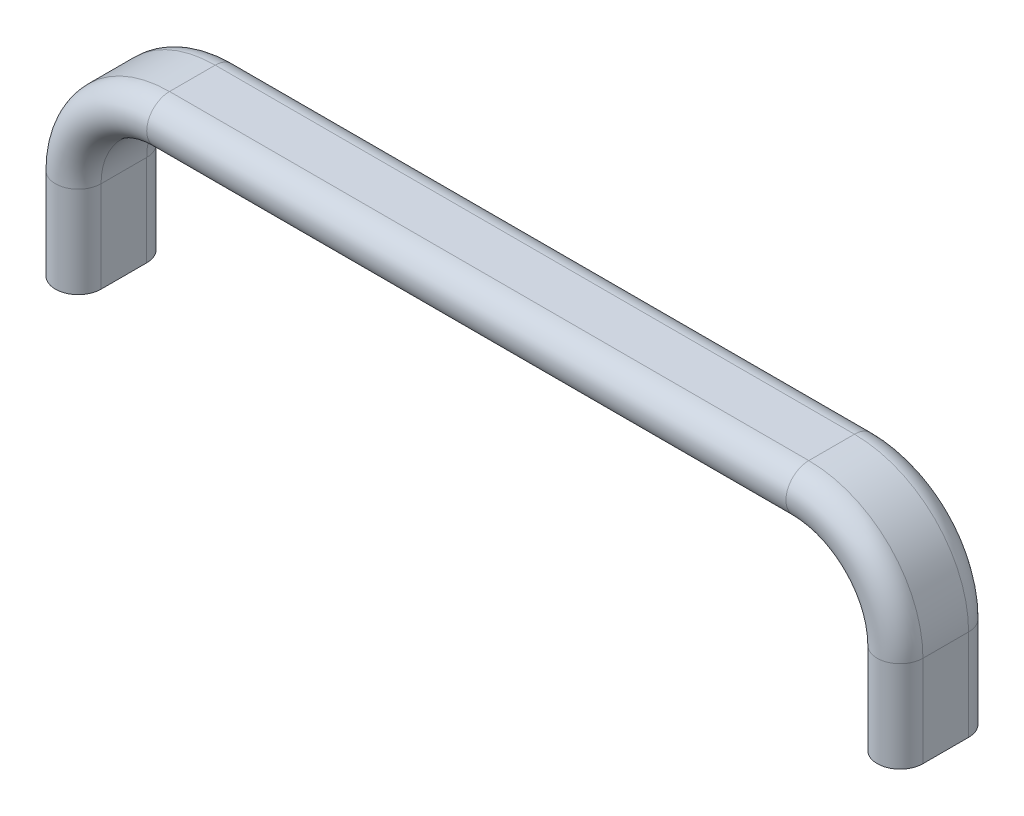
ISO-10303-21;
HEADER;
FILE_DESCRIPTION(('STEP AP214'),'2;1');
FILE_NAME('part.step','',(''),(''),'','','');
FILE_SCHEMA(('AUTOMOTIVE_DESIGN { 1 0 10303 214 1 1 1 1 }'));
ENDSEC;
DATA;
#1=APPLICATION_CONTEXT('core data for automotive mechanical design processes');
#2=APPLICATION_PROTOCOL_DEFINITION('international standard','automotive_design',2000,#1);
#3=PRODUCT_CONTEXT('',#1,'mechanical');
#4=PRODUCT('Part','Part','',(#3));
#5=PRODUCT_RELATED_PRODUCT_CATEGORY('part','',(#4));
#6=PRODUCT_DEFINITION_FORMATION('','',#4);
#7=PRODUCT_DEFINITION_CONTEXT('part definition',#1,'design');
#8=PRODUCT_DEFINITION('design','',#6,#7);
#9=PRODUCT_DEFINITION_SHAPE('','',#8);
#10=(LENGTH_UNIT() NAMED_UNIT(*) SI_UNIT(.MILLI.,.METRE.));
#11=(NAMED_UNIT(*) PLANE_ANGLE_UNIT() SI_UNIT($,.RADIAN.));
#12=(NAMED_UNIT(*) SI_UNIT($,.STERADIAN.) SOLID_ANGLE_UNIT());
#13=UNCERTAINTY_MEASURE_WITH_UNIT(LENGTH_MEASURE(1.E-05),#10,'distance_accuracy_value','');
#14=(GEOMETRIC_REPRESENTATION_CONTEXT(3) GLOBAL_UNCERTAINTY_ASSIGNED_CONTEXT((#13)) GLOBAL_UNIT_ASSIGNED_CONTEXT((#10,
#11,#12)) REPRESENTATION_CONTEXT('',''));
#15=CARTESIAN_POINT('',(0.,0.,0.));
#16=DIRECTION('',(0.,0.,1.));
#17=DIRECTION('',(1.,0.,0.));
#18=AXIS2_PLACEMENT_3D('',#15,#16,#17);
#19=CARTESIAN_POINT('',(90.,0.,-5.));
#20=DIRECTION('',(0.,1.,0.));
#21=DIRECTION('',(0.,0.,-1.));
#22=AXIS2_PLACEMENT_3D('',#19,#20,#21);
#23=PLANE('',#22);
#24=CARTESIAN_POINT('',(90.,0.,-5.));
#25=DIRECTION('',(0.,-1.,0.));
#26=DIRECTION('',(0.,0.,-1.));
#27=AXIS2_PLACEMENT_3D('',#24,#25,#26);
#28=CIRCLE('',#27,5.);
#29=CARTESIAN_POINT('',(85.,0.,-5.));
#30=VERTEX_POINT('',#29);
#31=CARTESIAN_POINT('',(95.,0.,-5.));
#32=VERTEX_POINT('',#31);
#33=EDGE_CURVE('E278',#30,#32,#28,.T.);
#34=ORIENTED_EDGE('',*,*,#33,.T.);
#35=DIRECTION('',(0.,0.,1.));
#36=VECTOR('',#35,1.);
#37=CARTESIAN_POINT('',(95.,0.,5.00000000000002));
#38=LINE('',#37,#36);
#39=CARTESIAN_POINT('',(95.,0.,5.00000000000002));
#40=VERTEX_POINT('',#39);
#41=EDGE_CURVE('E55',#32,#40,#38,.T.);
#42=ORIENTED_EDGE('',*,*,#41,.T.);
#43=CARTESIAN_POINT('',(90.,0.,5.00000000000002));
#44=DIRECTION('',(0.,-1.,0.));
#45=DIRECTION('',(0.,0.,1.));
#46=AXIS2_PLACEMENT_3D('',#43,#44,#45);
#47=CIRCLE('',#46,5.);
#48=CARTESIAN_POINT('',(85.,0.,5.00000000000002));
#49=VERTEX_POINT('',#48);
#50=EDGE_CURVE('E63',#40,#49,#47,.T.);
#51=ORIENTED_EDGE('',*,*,#50,.T.);
#52=DIRECTION('',(0.,0.,-1.));
#53=VECTOR('',#52,1.);
#54=CARTESIAN_POINT('',(85.,0.,-5.));
#55=LINE('',#54,#53);
#56=EDGE_CURVE('E281',#49,#30,#55,.T.);
#57=ORIENTED_EDGE('',*,*,#56,.T.);
#58=EDGE_LOOP('',(#34,#42,#51,#57));
#59=FACE_BOUND('',#58,.T.);
#60=CARTESIAN_POINT('',(90.,0.,0.));
#61=DIRECTION('',(0.,1.,0.));
#62=DIRECTION('',(0.,0.,-1.));
#63=AXIS2_PLACEMENT_3D('',#60,#61,#62);
#64=CIRCLE('',#63,2.5);
#65=CARTESIAN_POINT('',(90.,0.,-2.5));
#66=VERTEX_POINT('',#65);
#67=EDGE_CURVE('E444',#66,#66,#64,.T.);
#68=ORIENTED_EDGE('',*,*,#67,.T.);
#69=EDGE_LOOP('',(#68));
#70=FACE_BOUND('',#69,.T.);
#71=ADVANCED_FACE('F37',(#59,#70),#23,.F.);
#72=CARTESIAN_POINT('',(95.,20.,5.00000000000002));
#73=DIRECTION('',(1.,0.,0.));
#74=DIRECTION('',(0.,0.,-1.));
#75=AXIS2_PLACEMENT_3D('',#72,#73,#74);
#76=PLANE('',#75);
#77=DIRECTION('',(0.,0.,1.));
#78=VECTOR('',#77,1.);
#79=CARTESIAN_POINT('',(95.,20.,5.00000000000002));
#80=LINE('',#79,#78);
#81=CARTESIAN_POINT('',(95.,20.,-5.));
#82=VERTEX_POINT('',#81);
#83=CARTESIAN_POINT('',(95.,20.,5.00000000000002));
#84=VERTEX_POINT('',#83);
#85=EDGE_CURVE('E247',#82,#84,#80,.T.);
#86=ORIENTED_EDGE('',*,*,#85,.T.);
#87=DIRECTION('',(0.,-1.,0.));
#88=VECTOR('',#87,1.);
#89=CARTESIAN_POINT('',(95.,20.,5.00000000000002));
#90=LINE('',#89,#88);
#91=EDGE_CURVE('E47',#84,#40,#90,.T.);
#92=ORIENTED_EDGE('',*,*,#91,.T.);
#93=ORIENTED_EDGE('',*,*,#41,.F.);
#94=DIRECTION('',(0.,-1.,0.));
#95=VECTOR('',#94,1.);
#96=CARTESIAN_POINT('',(95.,20.,-5.));
#97=LINE('',#96,#95);
#98=EDGE_CURVE('E11',#82,#32,#97,.T.);
#99=ORIENTED_EDGE('',*,*,#98,.F.);
#100=EDGE_LOOP('',(#86,#92,#93,#99));
#101=FACE_BOUND('',#100,.T.);
#102=ADVANCED_FACE('F39',(#101),#76,.T.);
#103=CARTESIAN_POINT('',(90.,20.,5.00000000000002));
#104=DIRECTION('',(0.,-1.,0.));
#105=DIRECTION('',(0.,0.,-1.));
#106=AXIS2_PLACEMENT_3D('',#103,#104,#105);
#107=CYLINDRICAL_SURFACE('',#106,5.);
#108=CARTESIAN_POINT('',(90.,20.,5.00000000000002));
#109=DIRECTION('',(0.,-1.,0.));
#110=DIRECTION('',(0.,0.,1.));
#111=AXIS2_PLACEMENT_3D('',#108,#109,#110);
#112=CIRCLE('',#111,5.);
#113=CARTESIAN_POINT('',(85.,20.,5.00000000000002));
#114=VERTEX_POINT('',#113);
#115=EDGE_CURVE('E240',#84,#114,#112,.T.);
#116=ORIENTED_EDGE('',*,*,#115,.T.);
#117=DIRECTION('',(0.,-1.,0.));
#118=VECTOR('',#117,1.);
#119=CARTESIAN_POINT('',(85.,20.,5.00000000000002));
#120=LINE('',#119,#118);
#121=EDGE_CURVE('E242',#114,#49,#120,.T.);
#122=ORIENTED_EDGE('',*,*,#121,.T.);
#123=ORIENTED_EDGE('',*,*,#50,.F.);
#124=ORIENTED_EDGE('',*,*,#91,.F.);
#125=EDGE_LOOP('',(#116,#122,#123,#124));
#126=FACE_BOUND('',#125,.T.);
#127=ADVANCED_FACE('F153',(#126),#107,.T.);
#128=CARTESIAN_POINT('',(85.,20.,-5.));
#129=DIRECTION('',(-1.,0.,0.));
#130=DIRECTION('',(0.,0.,1.));
#131=AXIS2_PLACEMENT_3D('',#128,#129,#130);
#132=PLANE('',#131);
#133=DIRECTION('',(0.,0.,-1.));
#134=VECTOR('',#133,1.);
#135=CARTESIAN_POINT('',(85.,20.,-5.));
#136=LINE('',#135,#134);
#137=CARTESIAN_POINT('',(85.,20.,-5.));
#138=VERTEX_POINT('',#137);
#139=EDGE_CURVE('E248',#114,#138,#136,.T.);
#140=ORIENTED_EDGE('',*,*,#139,.T.);
#141=DIRECTION('',(0.,-1.,0.));
#142=VECTOR('',#141,1.);
#143=CARTESIAN_POINT('',(85.,20.,-5.));
#144=LINE('',#143,#142);
#145=EDGE_CURVE('E289',#138,#30,#144,.T.);
#146=ORIENTED_EDGE('',*,*,#145,.T.);
#147=ORIENTED_EDGE('',*,*,#56,.F.);
#148=ORIENTED_EDGE('',*,*,#121,.F.);
#149=EDGE_LOOP('',(#140,#146,#147,#148));
#150=FACE_BOUND('',#149,.T.);
#151=ADVANCED_FACE('F231',(#150),#132,.T.);
#152=CARTESIAN_POINT('',(90.,20.,-5.));
#153=DIRECTION('',(0.,-1.,0.));
#154=DIRECTION('',(0.,0.,-1.));
#155=AXIS2_PLACEMENT_3D('',#152,#153,#154);
#156=CYLINDRICAL_SURFACE('',#155,5.);
#157=CARTESIAN_POINT('',(90.,20.,-5.));
#158=DIRECTION('',(0.,-1.,0.));
#159=DIRECTION('',(0.,0.,-1.));
#160=AXIS2_PLACEMENT_3D('',#157,#158,#159);
#161=CIRCLE('',#160,5.);
#162=EDGE_CURVE('E259',#138,#82,#161,.T.);
#163=ORIENTED_EDGE('',*,*,#162,.T.);
#164=ORIENTED_EDGE('',*,*,#98,.T.);
#165=ORIENTED_EDGE('',*,*,#33,.F.);
#166=ORIENTED_EDGE('',*,*,#145,.F.);
#167=EDGE_LOOP('',(#163,#164,#165,#166));
#168=FACE_BOUND('',#167,.T.);
#169=ADVANCED_FACE('F227',(#168),#156,.T.);
#170=CARTESIAN_POINT('',(70.,20.,0.));
#171=DIRECTION('',(0.,0.,-1.));
#172=DIRECTION('',(-1.,0.,0.));
#173=AXIS2_PLACEMENT_3D('',#170,#171,#172);
#174=CYLINDRICAL_SURFACE('',#173,25.);
#175=DIRECTION('',(0.,0.,1.));
#176=VECTOR('',#175,1.);
#177=CARTESIAN_POINT('',(70.,45.,5.00000000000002));
#178=LINE('',#177,#176);
#179=CARTESIAN_POINT('',(70.,45.,-5.));
#180=VERTEX_POINT('',#179);
#181=CARTESIAN_POINT('',(70.,45.,5.00000000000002));
#182=VERTEX_POINT('',#181);
#183=EDGE_CURVE('E401',#180,#182,#178,.T.);
#184=ORIENTED_EDGE('',*,*,#183,.T.);
#185=CARTESIAN_POINT('',(70.,20.,5.00000000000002));
#186=DIRECTION('',(0.,0.,-1.));
#187=DIRECTION('',(-1.,0.,0.));
#188=AXIS2_PLACEMENT_3D('',#185,#186,#187);
#189=CIRCLE('',#188,25.);
#190=EDGE_CURVE('E265',#182,#84,#189,.T.);
#191=ORIENTED_EDGE('',*,*,#190,.T.);
#192=ORIENTED_EDGE('',*,*,#85,.F.);
#193=CARTESIAN_POINT('',(70.,20.,-5.));
#194=DIRECTION('',(0.,0.,-1.));
#195=DIRECTION('',(-1.,0.,0.));
#196=AXIS2_PLACEMENT_3D('',#193,#194,#195);
#197=CIRCLE('',#196,25.);
#198=EDGE_CURVE('E269',#180,#82,#197,.T.);
#199=ORIENTED_EDGE('',*,*,#198,.F.);
#200=EDGE_LOOP('',(#184,#191,#192,#199));
#201=FACE_BOUND('',#200,.T.);
#202=ADVANCED_FACE('F223',(#201),#174,.T.);
#203=CARTESIAN_POINT('',(70.,20.,5.00000000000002));
#204=DIRECTION('',(0.,0.,-1.));
#205=DIRECTION('',(-1.,0.,0.));
#206=AXIS2_PLACEMENT_3D('',#203,#204,#205);
#207=TOROIDAL_SURFACE('',#206,20.,5.);
#208=CARTESIAN_POINT('',(70.,40.,5.00000000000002));
#209=DIRECTION('',(1.,0.,0.));
#210=DIRECTION('',(0.,0.,1.));
#211=AXIS2_PLACEMENT_3D('',#208,#209,#210);
#212=CIRCLE('',#211,5.);
#213=CARTESIAN_POINT('',(70.,35.,5.00000000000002));
#214=VERTEX_POINT('',#213);
#215=EDGE_CURVE('E262',#182,#214,#212,.T.);
#216=ORIENTED_EDGE('',*,*,#215,.T.);
#217=CARTESIAN_POINT('',(70.,20.,5.00000000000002));
#218=DIRECTION('',(0.,0.,-1.));
#219=DIRECTION('',(-1.,0.,0.));
#220=AXIS2_PLACEMENT_3D('',#217,#218,#219);
#221=CIRCLE('',#220,15.);
#222=EDGE_CURVE('E253',#214,#114,#221,.T.);
#223=ORIENTED_EDGE('',*,*,#222,.T.);
#224=ORIENTED_EDGE('',*,*,#115,.F.);
#225=ORIENTED_EDGE('',*,*,#190,.F.);
#226=EDGE_LOOP('',(#216,#223,#224,#225));
#227=FACE_BOUND('',#226,.T.);
#228=ADVANCED_FACE('F219',(#227),#207,.T.);
#229=CARTESIAN_POINT('',(70.,20.,0.));
#230=DIRECTION('',(0.,0.,-1.));
#231=DIRECTION('',(-1.,0.,0.));
#232=AXIS2_PLACEMENT_3D('',#229,#230,#231);
#233=CYLINDRICAL_SURFACE('',#232,15.);
#234=DIRECTION('',(0.,0.,-1.));
#235=VECTOR('',#234,1.);
#236=CARTESIAN_POINT('',(70.,35.,-5.));
#237=LINE('',#236,#235);
#238=CARTESIAN_POINT('',(70.,35.,-5.));
#239=VERTEX_POINT('',#238);
#240=EDGE_CURVE('E396',#214,#239,#237,.T.);
#241=ORIENTED_EDGE('',*,*,#240,.T.);
#242=CARTESIAN_POINT('',(70.,20.,-5.));
#243=DIRECTION('',(0.,0.,-1.));
#244=DIRECTION('',(-1.,0.,0.));
#245=AXIS2_PLACEMENT_3D('',#242,#243,#244);
#246=CIRCLE('',#245,15.);
#247=EDGE_CURVE('E255',#239,#138,#246,.T.);
#248=ORIENTED_EDGE('',*,*,#247,.T.);
#249=ORIENTED_EDGE('',*,*,#139,.F.);
#250=ORIENTED_EDGE('',*,*,#222,.F.);
#251=EDGE_LOOP('',(#241,#248,#249,#250));
#252=FACE_BOUND('',#251,.T.);
#253=ADVANCED_FACE('F215',(#252),#233,.F.);
#254=CARTESIAN_POINT('',(70.,20.,-5.));
#255=DIRECTION('',(0.,0.,-1.));
#256=DIRECTION('',(-1.,0.,0.));
#257=AXIS2_PLACEMENT_3D('',#254,#255,#256);
#258=TOROIDAL_SURFACE('',#257,20.,5.);
#259=CARTESIAN_POINT('',(70.,40.,-5.));
#260=DIRECTION('',(1.,0.,0.));
#261=DIRECTION('',(0.,0.,-1.));
#262=AXIS2_PLACEMENT_3D('',#259,#260,#261);
#263=CIRCLE('',#262,5.);
#264=EDGE_CURVE('E392',#239,#180,#263,.T.);
#265=ORIENTED_EDGE('',*,*,#264,.T.);
#266=ORIENTED_EDGE('',*,*,#198,.T.);
#267=ORIENTED_EDGE('',*,*,#162,.F.);
#268=ORIENTED_EDGE('',*,*,#247,.F.);
#269=EDGE_LOOP('',(#265,#266,#267,#268));
#270=FACE_BOUND('',#269,.T.);
#271=ADVANCED_FACE('F211',(#270),#258,.T.);
#272=CARTESIAN_POINT('',(-70.,45.,5.00000000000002));
#273=DIRECTION('',(0.,1.,0.));
#274=DIRECTION('',(-1.,0.,0.));
#275=AXIS2_PLACEMENT_3D('',#272,#273,#274);
#276=PLANE('',#275);
#277=DIRECTION('',(0.,0.,1.));
#278=VECTOR('',#277,1.);
#279=CARTESIAN_POINT('',(-70.,45.,5.00000000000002));
#280=LINE('',#279,#278);
#281=CARTESIAN_POINT('',(-70.,45.,-5.));
#282=VERTEX_POINT('',#281);
#283=CARTESIAN_POINT('',(-70.,45.,5.00000000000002));
#284=VERTEX_POINT('',#283);
#285=EDGE_CURVE('E373',#282,#284,#280,.T.);
#286=ORIENTED_EDGE('',*,*,#285,.T.);
#287=DIRECTION('',(1.,0.,0.));
#288=VECTOR('',#287,1.);
#289=CARTESIAN_POINT('',(-70.,45.,5.00000000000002));
#290=LINE('',#289,#288);
#291=EDGE_CURVE('E412',#284,#182,#290,.T.);
#292=ORIENTED_EDGE('',*,*,#291,.T.);
#293=ORIENTED_EDGE('',*,*,#183,.F.);
#294=DIRECTION('',(1.,0.,0.));
#295=VECTOR('',#294,1.);
#296=CARTESIAN_POINT('',(-70.,45.,-5.));
#297=LINE('',#296,#295);
#298=EDGE_CURVE('E416',#282,#180,#297,.T.);
#299=ORIENTED_EDGE('',*,*,#298,.F.);
#300=EDGE_LOOP('',(#286,#292,#293,#299));
#301=FACE_BOUND('',#300,.T.);
#302=ADVANCED_FACE('F207',(#301),#276,.T.);
#303=CARTESIAN_POINT('',(-70.,40.,5.00000000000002));
#304=DIRECTION('',(1.,0.,0.));
#305=DIRECTION('',(0.,1.,0.));
#306=AXIS2_PLACEMENT_3D('',#303,#304,#305);
#307=CYLINDRICAL_SURFACE('',#306,5.);
#308=CARTESIAN_POINT('',(-70.,40.,5.00000000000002));
#309=DIRECTION('',(1.,0.,0.));
#310=DIRECTION('',(0.,0.,1.));
#311=AXIS2_PLACEMENT_3D('',#308,#309,#310);
#312=CIRCLE('',#311,5.);
#313=CARTESIAN_POINT('',(-70.,35.,5.00000000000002));
#314=VERTEX_POINT('',#313);
#315=EDGE_CURVE('E369',#284,#314,#312,.T.);
#316=ORIENTED_EDGE('',*,*,#315,.T.);
#317=DIRECTION('',(1.,0.,0.));
#318=VECTOR('',#317,1.);
#319=CARTESIAN_POINT('',(-70.,35.,5.00000000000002));
#320=LINE('',#319,#318);
#321=EDGE_CURVE('E408',#314,#214,#320,.T.);
#322=ORIENTED_EDGE('',*,*,#321,.T.);
#323=ORIENTED_EDGE('',*,*,#215,.F.);
#324=ORIENTED_EDGE('',*,*,#291,.F.);
#325=EDGE_LOOP('',(#316,#322,#323,#324));
#326=FACE_BOUND('',#325,.T.);
#327=ADVANCED_FACE('F203',(#326),#307,.T.);
#328=CARTESIAN_POINT('',(-70.,35.,-5.));
#329=DIRECTION('',(0.,-1.,0.));
#330=DIRECTION('',(1.,0.,0.));
#331=AXIS2_PLACEMENT_3D('',#328,#329,#330);
#332=PLANE('',#331);
#333=DIRECTION('',(0.,0.,-1.));
#334=VECTOR('',#333,1.);
#335=CARTESIAN_POINT('',(-70.,35.,-5.));
#336=LINE('',#335,#334);
#337=CARTESIAN_POINT('',(-70.,35.,-5.));
#338=VERTEX_POINT('',#337);
#339=EDGE_CURVE('E365',#314,#338,#336,.T.);
#340=ORIENTED_EDGE('',*,*,#339,.T.);
#341=DIRECTION('',(1.,0.,0.));
#342=VECTOR('',#341,1.);
#343=CARTESIAN_POINT('',(-70.,35.,-5.));
#344=LINE('',#343,#342);
#345=EDGE_CURVE('E404',#338,#239,#344,.T.);
#346=ORIENTED_EDGE('',*,*,#345,.T.);
#347=ORIENTED_EDGE('',*,*,#240,.F.);
#348=ORIENTED_EDGE('',*,*,#321,.F.);
#349=EDGE_LOOP('',(#340,#346,#347,#348));
#350=FACE_BOUND('',#349,.T.);
#351=ADVANCED_FACE('F199',(#350),#332,.T.);
#352=CARTESIAN_POINT('',(-70.,40.,-5.));
#353=DIRECTION('',(1.,0.,0.));
#354=DIRECTION('',(0.,1.,0.));
#355=AXIS2_PLACEMENT_3D('',#352,#353,#354);
#356=CYLINDRICAL_SURFACE('',#355,5.);
#357=CARTESIAN_POINT('',(-70.,40.,-5.));
#358=DIRECTION('',(1.,0.,0.));
#359=DIRECTION('',(0.,0.,-1.));
#360=AXIS2_PLACEMENT_3D('',#357,#358,#359);
#361=CIRCLE('',#360,5.);
#362=EDGE_CURVE('E361',#338,#282,#361,.T.);
#363=ORIENTED_EDGE('',*,*,#362,.T.);
#364=ORIENTED_EDGE('',*,*,#298,.T.);
#365=ORIENTED_EDGE('',*,*,#264,.F.);
#366=ORIENTED_EDGE('',*,*,#345,.F.);
#367=EDGE_LOOP('',(#363,#364,#365,#366));
#368=FACE_BOUND('',#367,.T.);
#369=ADVANCED_FACE('F195',(#368),#356,.T.);
#370=CARTESIAN_POINT('',(-70.,20.,0.));
#371=DIRECTION('',(0.,0.,-1.));
#372=DIRECTION('',(-1.,0.,0.));
#373=AXIS2_PLACEMENT_3D('',#370,#371,#372);
#374=CYLINDRICAL_SURFACE('',#373,25.);
#375=DIRECTION('',(0.,0.,1.));
#376=VECTOR('',#375,1.);
#377=CARTESIAN_POINT('',(-95.,20.,5.00000000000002));
#378=LINE('',#377,#376);
#379=CARTESIAN_POINT('',(-95.,20.,-5.));
#380=VERTEX_POINT('',#379);
#381=CARTESIAN_POINT('',(-95.,20.,5.00000000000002));
#382=VERTEX_POINT('',#381);
#383=EDGE_CURVE('E327',#380,#382,#378,.T.);
#384=ORIENTED_EDGE('',*,*,#383,.T.);
#385=CARTESIAN_POINT('',(-70.,20.,5.00000000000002));
#386=DIRECTION('',(0.,0.,-1.));
#387=DIRECTION('',(-1.,0.,0.));
#388=AXIS2_PLACEMENT_3D('',#385,#386,#387);
#389=CIRCLE('',#388,25.);
#390=EDGE_CURVE('E384',#382,#284,#389,.T.);
#391=ORIENTED_EDGE('',*,*,#390,.T.);
#392=ORIENTED_EDGE('',*,*,#285,.F.);
#393=CARTESIAN_POINT('',(-70.,20.,-5.));
#394=DIRECTION('',(0.,0.,-1.));
#395=DIRECTION('',(-1.,0.,0.));
#396=AXIS2_PLACEMENT_3D('',#393,#394,#395);
#397=CIRCLE('',#396,25.);
#398=EDGE_CURVE('E388',#380,#282,#397,.T.);
#399=ORIENTED_EDGE('',*,*,#398,.F.);
#400=EDGE_LOOP('',(#384,#391,#392,#399));
#401=FACE_BOUND('',#400,.T.);
#402=ADVANCED_FACE('F191',(#401),#374,.T.);
#403=CARTESIAN_POINT('',(-70.,20.,5.00000000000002));
#404=DIRECTION('',(0.,0.,-1.));
#405=DIRECTION('',(-1.,0.,0.));
#406=AXIS2_PLACEMENT_3D('',#403,#404,#405);
#407=TOROIDAL_SURFACE('',#406,20.,5.);
#408=CARTESIAN_POINT('',(-90.,20.,5.00000000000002));
#409=DIRECTION('',(0.,1.,0.));
#410=DIRECTION('',(0.,0.,1.));
#411=AXIS2_PLACEMENT_3D('',#408,#409,#410);
#412=CIRCLE('',#411,5.);
#413=CARTESIAN_POINT('',(-85.,20.,5.00000000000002));
#414=VERTEX_POINT('',#413);
#415=EDGE_CURVE('E332',#382,#414,#412,.T.);
#416=ORIENTED_EDGE('',*,*,#415,.T.);
#417=CARTESIAN_POINT('',(-70.,20.,5.00000000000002));
#418=DIRECTION('',(0.,0.,-1.));
#419=DIRECTION('',(-1.,0.,0.));
#420=AXIS2_PLACEMENT_3D('',#417,#418,#419);
#421=CIRCLE('',#420,15.);
#422=EDGE_CURVE('E381',#414,#314,#421,.T.);
#423=ORIENTED_EDGE('',*,*,#422,.T.);
#424=ORIENTED_EDGE('',*,*,#315,.F.);
#425=ORIENTED_EDGE('',*,*,#390,.F.);
#426=EDGE_LOOP('',(#416,#423,#424,#425));
#427=FACE_BOUND('',#426,.T.);
#428=ADVANCED_FACE('F187',(#427),#407,.T.);
#429=CARTESIAN_POINT('',(-70.,20.,0.));
#430=DIRECTION('',(0.,0.,-1.));
#431=DIRECTION('',(-1.,0.,0.));
#432=AXIS2_PLACEMENT_3D('',#429,#430,#431);
#433=CYLINDRICAL_SURFACE('',#432,15.);
#434=DIRECTION('',(0.,0.,-1.));
#435=VECTOR('',#434,1.);
#436=CARTESIAN_POINT('',(-85.,20.,-5.));
#437=LINE('',#436,#435);
#438=CARTESIAN_POINT('',(-85.,20.,-5.));
#439=VERTEX_POINT('',#438);
#440=EDGE_CURVE('E336',#414,#439,#437,.T.);
#441=ORIENTED_EDGE('',*,*,#440,.T.);
#442=CARTESIAN_POINT('',(-70.,20.,-5.));
#443=DIRECTION('',(0.,0.,-1.));
#444=DIRECTION('',(-1.,0.,0.));
#445=AXIS2_PLACEMENT_3D('',#442,#443,#444);
#446=CIRCLE('',#445,15.);
#447=EDGE_CURVE('E377',#439,#338,#446,.T.);
#448=ORIENTED_EDGE('',*,*,#447,.T.);
#449=ORIENTED_EDGE('',*,*,#339,.F.);
#450=ORIENTED_EDGE('',*,*,#422,.F.);
#451=EDGE_LOOP('',(#441,#448,#449,#450));
#452=FACE_BOUND('',#451,.T.);
#453=ADVANCED_FACE('F183',(#452),#433,.F.);
#454=CARTESIAN_POINT('',(-70.,20.,-5.));
#455=DIRECTION('',(0.,0.,-1.));
#456=DIRECTION('',(-1.,0.,0.));
#457=AXIS2_PLACEMENT_3D('',#454,#455,#456);
#458=TOROIDAL_SURFACE('',#457,20.,5.);
#459=CARTESIAN_POINT('',(-90.,20.,-5.));
#460=DIRECTION('',(0.,1.,0.));
#461=DIRECTION('',(0.,0.,-1.));
#462=AXIS2_PLACEMENT_3D('',#459,#460,#461);
#463=CIRCLE('',#462,5.);
#464=EDGE_CURVE('E323',#439,#380,#463,.T.);
#465=ORIENTED_EDGE('',*,*,#464,.T.);
#466=ORIENTED_EDGE('',*,*,#398,.T.);
#467=ORIENTED_EDGE('',*,*,#362,.F.);
#468=ORIENTED_EDGE('',*,*,#447,.F.);
#469=EDGE_LOOP('',(#465,#466,#467,#468));
#470=FACE_BOUND('',#469,.T.);
#471=ADVANCED_FACE('F179',(#470),#458,.T.);
#472=CARTESIAN_POINT('',(-90.,20.,-5.));
#473=DIRECTION('',(0.,-1.,0.));
#474=DIRECTION('',(0.,0.,-1.));
#475=AXIS2_PLACEMENT_3D('',#472,#473,#474);
#476=CYLINDRICAL_SURFACE('',#475,5.);
#477=CARTESIAN_POINT('',(-90.,0.,-5.));
#478=DIRECTION('',(0.,1.,0.));
#479=DIRECTION('',(0.,0.,-1.));
#480=AXIS2_PLACEMENT_3D('',#477,#478,#479);
#481=CIRCLE('',#480,5.);
#482=CARTESIAN_POINT('',(-85.,0.,-5.));
#483=VERTEX_POINT('',#482);
#484=CARTESIAN_POINT('',(-95.,0.,-5.));
#485=VERTEX_POINT('',#484);
#486=EDGE_CURVE('E298',#483,#485,#481,.T.);
#487=ORIENTED_EDGE('',*,*,#486,.T.);
#488=DIRECTION('',(0.,-1.,0.));
#489=VECTOR('',#488,1.);
#490=CARTESIAN_POINT('',(-95.,20.,-5.));
#491=LINE('',#490,#489);
#492=EDGE_CURVE('E357',#380,#485,#491,.T.);
#493=ORIENTED_EDGE('',*,*,#492,.F.);
#494=ORIENTED_EDGE('',*,*,#464,.F.);
#495=DIRECTION('',(0.,-1.,0.));
#496=VECTOR('',#495,1.);
#497=CARTESIAN_POINT('',(-85.,20.,-5.));
#498=LINE('',#497,#496);
#499=EDGE_CURVE('E338',#439,#483,#498,.T.);
#500=ORIENTED_EDGE('',*,*,#499,.T.);
#501=EDGE_LOOP('',(#487,#493,#494,#500));
#502=FACE_BOUND('',#501,.T.);
#503=ADVANCED_FACE('F175',(#502),#476,.T.);
#504=CARTESIAN_POINT('',(-95.,20.,5.00000000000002));
#505=DIRECTION('',(1.,0.,0.));
#506=DIRECTION('',(0.,0.,-1.));
#507=AXIS2_PLACEMENT_3D('',#504,#505,#506);
#508=PLANE('',#507);
#509=DIRECTION('',(0.,0.,1.));
#510=VECTOR('',#509,1.);
#511=CARTESIAN_POINT('',(-95.,0.,5.00000000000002));
#512=LINE('',#511,#510);
#513=CARTESIAN_POINT('',(-95.,0.,5.00000000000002));
#514=VERTEX_POINT('',#513);
#515=EDGE_CURVE('E306',#485,#514,#512,.T.);
#516=ORIENTED_EDGE('',*,*,#515,.T.);
#517=DIRECTION('',(0.,-1.,0.));
#518=VECTOR('',#517,1.);
#519=CARTESIAN_POINT('',(-95.,20.,5.00000000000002));
#520=LINE('',#519,#518);
#521=EDGE_CURVE('E353',#382,#514,#520,.T.);
#522=ORIENTED_EDGE('',*,*,#521,.F.);
#523=ORIENTED_EDGE('',*,*,#383,.F.);
#524=ORIENTED_EDGE('',*,*,#492,.T.);
#525=EDGE_LOOP('',(#516,#522,#523,#524));
#526=FACE_BOUND('',#525,.T.);
#527=ADVANCED_FACE('F171',(#526),#508,.F.);
#528=CARTESIAN_POINT('',(-90.,20.,5.00000000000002));
#529=DIRECTION('',(0.,-1.,0.));
#530=DIRECTION('',(0.,0.,-1.));
#531=AXIS2_PLACEMENT_3D('',#528,#529,#530);
#532=CYLINDRICAL_SURFACE('',#531,5.);
#533=CARTESIAN_POINT('',(-90.,0.,5.00000000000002));
#534=DIRECTION('',(0.,1.,0.));
#535=DIRECTION('',(0.,0.,1.));
#536=AXIS2_PLACEMENT_3D('',#533,#534,#535);
#537=CIRCLE('',#536,5.);
#538=CARTESIAN_POINT('',(-85.,0.,5.00000000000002));
#539=VERTEX_POINT('',#538);
#540=EDGE_CURVE('E342',#514,#539,#537,.T.);
#541=ORIENTED_EDGE('',*,*,#540,.T.);
#542=DIRECTION('',(0.,-1.,0.));
#543=VECTOR('',#542,1.);
#544=CARTESIAN_POINT('',(-85.,20.,5.00000000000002));
#545=LINE('',#544,#543);
#546=EDGE_CURVE('E349',#414,#539,#545,.T.);
#547=ORIENTED_EDGE('',*,*,#546,.F.);
#548=ORIENTED_EDGE('',*,*,#415,.F.);
#549=ORIENTED_EDGE('',*,*,#521,.T.);
#550=EDGE_LOOP('',(#541,#547,#548,#549));
#551=FACE_BOUND('',#550,.T.);
#552=ADVANCED_FACE('F167',(#551),#532,.T.);
#553=CARTESIAN_POINT('',(-85.,20.,-5.));
#554=DIRECTION('',(-1.,0.,0.));
#555=DIRECTION('',(0.,0.,1.));
#556=AXIS2_PLACEMENT_3D('',#553,#554,#555);
#557=PLANE('',#556);
#558=DIRECTION('',(0.,0.,-1.));
#559=VECTOR('',#558,1.);
#560=CARTESIAN_POINT('',(-85.,0.,-5.));
#561=LINE('',#560,#559);
#562=EDGE_CURVE('E328',#539,#483,#561,.T.);
#563=ORIENTED_EDGE('',*,*,#562,.T.);
#564=ORIENTED_EDGE('',*,*,#499,.F.);
#565=ORIENTED_EDGE('',*,*,#440,.F.);
#566=ORIENTED_EDGE('',*,*,#546,.T.);
#567=EDGE_LOOP('',(#563,#564,#565,#566));
#568=FACE_BOUND('',#567,.T.);
#569=ADVANCED_FACE('F163',(#568),#557,.F.);
#570=CARTESIAN_POINT('',(-90.,0.,-5.));
#571=DIRECTION('',(0.,-1.,0.));
#572=DIRECTION('',(0.,0.,-1.));
#573=AXIS2_PLACEMENT_3D('',#570,#571,#572);
#574=PLANE('',#573);
#575=CARTESIAN_POINT('',(-90.,0.,0.));
#576=DIRECTION('',(0.,-1.,0.));
#577=DIRECTION('',(0.,0.,-1.));
#578=AXIS2_PLACEMENT_3D('',#575,#576,#577);
#579=CIRCLE('',#578,2.5);
#580=CARTESIAN_POINT('',(-90.,0.,-2.5));
#581=VERTEX_POINT('',#580);
#582=EDGE_CURVE('E310',#581,#581,#579,.T.);
#583=ORIENTED_EDGE('',*,*,#582,.F.);
#584=EDGE_LOOP('',(#583));
#585=FACE_BOUND('',#584,.T.);
#586=ORIENTED_EDGE('',*,*,#486,.F.);
#587=ORIENTED_EDGE('',*,*,#562,.F.);
#588=ORIENTED_EDGE('',*,*,#540,.F.);
#589=ORIENTED_EDGE('',*,*,#515,.F.);
#590=EDGE_LOOP('',(#586,#587,#588,#589));
#591=FACE_BOUND('',#590,.T.);
#592=ADVANCED_FACE('F159',(#585,#591),#574,.T.);
#593=CARTESIAN_POINT('',(-90.,10.,0.));
#594=DIRECTION('',(0.,-1.,0.));
#595=DIRECTION('',(0.,0.,-1.));
#596=AXIS2_PLACEMENT_3D('',#593,#594,#595);
#597=PLANE('',#596);
#598=CARTESIAN_POINT('',(-90.,10.,0.));
#599=DIRECTION('',(0.,-1.,0.));
#600=DIRECTION('',(0.,0.,-1.));
#601=AXIS2_PLACEMENT_3D('',#598,#599,#600);
#602=CIRCLE('',#601,2.5);
#603=CARTESIAN_POINT('',(-90.,10.,-2.5));
#604=VERTEX_POINT('',#603);
#605=EDGE_CURVE('E299',#604,#604,#602,.T.);
#606=ORIENTED_EDGE('',*,*,#605,.T.);
#607=EDGE_LOOP('',(#606));
#608=FACE_BOUND('',#607,.T.);
#609=CARTESIAN_POINT('',(-90.,10.,0.));
#610=DIRECTION('',(0.,-1.,0.));
#611=DIRECTION('',(0.,0.,-1.));
#612=AXIS2_PLACEMENT_3D('',#609,#610,#611);
#613=CIRCLE('',#612,2.09999999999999);
#614=CARTESIAN_POINT('',(-90.,10.,-2.09999999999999));
#615=VERTEX_POINT('',#614);
#616=EDGE_CURVE('E295',#615,#615,#613,.F.);
#617=ORIENTED_EDGE('',*,*,#616,.T.);
#618=EDGE_LOOP('',(#617));
#619=FACE_BOUND('',#618,.T.);
#620=ADVANCED_FACE('F162',(#608,#619),#597,.T.);
#621=CARTESIAN_POINT('',(-90.,10.,0.));
#622=DIRECTION('',(0.,-1.,0.));
#623=DIRECTION('',(0.,0.,-1.));
#624=AXIS2_PLACEMENT_3D('',#621,#622,#623);
#625=CYLINDRICAL_SURFACE('',#624,2.5);
#626=ORIENTED_EDGE('',*,*,#605,.F.);
#627=EDGE_LOOP('',(#626));
#628=FACE_BOUND('',#627,.T.);
#629=ORIENTED_EDGE('',*,*,#582,.T.);
#630=EDGE_LOOP('',(#629));
#631=FACE_BOUND('',#630,.T.);
#632=ADVANCED_FACE('F472',(#628,#631),#625,.F.);
#633=CARTESIAN_POINT('',(-90.,12.5,0.));
#634=DIRECTION('',(0.,-1.,0.));
#635=DIRECTION('',(0.,0.,-1.));
#636=AXIS2_PLACEMENT_3D('',#633,#634,#635);
#637=CYLINDRICAL_SURFACE('',#636,2.09999999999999);
#638=CARTESIAN_POINT('',(-90.,12.5,0.));
#639=DIRECTION('',(0.,1.,0.));
#640=DIRECTION('',(0.,0.,1.));
#641=AXIS2_PLACEMENT_3D('',#638,#639,#640);
#642=CIRCLE('',#641,2.1);
#643=CARTESIAN_POINT('',(-90.,12.5,2.1));
#644=VERTEX_POINT('',#643);
#645=EDGE_CURVE('E318',#644,#644,#642,.T.);
#646=ORIENTED_EDGE('',*,*,#645,.T.);
#647=EDGE_LOOP('',(#646));
#648=FACE_BOUND('',#647,.T.);
#649=ORIENTED_EDGE('',*,*,#616,.F.);
#650=EDGE_LOOP('',(#649));
#651=FACE_BOUND('',#650,.T.);
#652=ADVANCED_FACE('F157',(#648,#651),#637,.F.);
#653=CARTESIAN_POINT('',(-90.,13.7124355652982,0.));
#654=DIRECTION('',(0.,-1.,0.));
#655=DIRECTION('',(0.,0.,-1.));
#656=AXIS2_PLACEMENT_3D('',#653,#654,#655);
#657=CONICAL_SURFACE('',#656,0.,1.0471975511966);
#658=ORIENTED_EDGE('',*,*,#645,.F.);
#659=EDGE_LOOP('',(#658));
#660=FACE_BOUND('',#659,.T.);
#661=CARTESIAN_POINT('',(-90.,13.7124355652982,0.));
#662=VERTEX_POINT('',#661);
#663=VERTEX_LOOP('',#662);
#664=FACE_BOUND('',#663,.T.);
#665=ADVANCED_FACE('F465',(#660,#664),#657,.F.);
#666=CARTESIAN_POINT('',(90.,10.,0.));
#667=DIRECTION('',(0.,-1.,0.));
#668=DIRECTION('',(0.,0.,-1.));
#669=AXIS2_PLACEMENT_3D('',#666,#667,#668);
#670=CYLINDRICAL_SURFACE('',#669,2.5);
#671=CARTESIAN_POINT('',(90.,10.,0.));
#672=DIRECTION('',(0.,1.,0.));
#673=DIRECTION('',(0.,0.,-1.));
#674=AXIS2_PLACEMENT_3D('',#671,#672,#673);
#675=CIRCLE('',#674,2.5);
#676=CARTESIAN_POINT('',(90.,10.,-2.5));
#677=VERTEX_POINT('',#676);
#678=EDGE_CURVE('E442',#677,#677,#675,.T.);
#679=ORIENTED_EDGE('',*,*,#678,.T.);
#680=EDGE_LOOP('',(#679));
#681=FACE_BOUND('',#680,.T.);
#682=ORIENTED_EDGE('',*,*,#67,.F.);
#683=EDGE_LOOP('',(#682));
#684=FACE_BOUND('',#683,.T.);
#685=ADVANCED_FACE('F461',(#681,#684),#670,.F.);
#686=CARTESIAN_POINT('',(90.,10.,0.));
#687=DIRECTION('',(0.,-1.,0.));
#688=DIRECTION('',(0.,0.,-1.));
#689=AXIS2_PLACEMENT_3D('',#686,#687,#688);
#690=PLANE('',#689);
#691=CARTESIAN_POINT('',(90.,10.,0.));
#692=DIRECTION('',(0.,-1.,0.));
#693=DIRECTION('',(0.,0.,-1.));
#694=AXIS2_PLACEMENT_3D('',#691,#692,#693);
#695=CIRCLE('',#694,2.09999999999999);
#696=CARTESIAN_POINT('',(90.,10.,-2.09999999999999));
#697=VERTEX_POINT('',#696);
#698=EDGE_CURVE('E41',#697,#697,#695,.T.);
#699=ORIENTED_EDGE('',*,*,#698,.F.);
#700=EDGE_LOOP('',(#699));
#701=FACE_BOUND('',#700,.T.);
#702=ORIENTED_EDGE('',*,*,#678,.F.);
#703=EDGE_LOOP('',(#702));
#704=FACE_BOUND('',#703,.T.);
#705=ADVANCED_FACE('F142',(#701,#704),#690,.T.);
#706=CARTESIAN_POINT('',(90.,12.5,0.));
#707=DIRECTION('',(0.,-1.,0.));
#708=DIRECTION('',(0.,0.,-1.));
#709=AXIS2_PLACEMENT_3D('',#706,#707,#708);
#710=CYLINDRICAL_SURFACE('',#709,2.09999999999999);
#711=CARTESIAN_POINT('',(90.,12.5,0.));
#712=DIRECTION('',(0.,-1.,0.));
#713=DIRECTION('',(0.,0.,1.));
#714=AXIS2_PLACEMENT_3D('',#711,#712,#713);
#715=CIRCLE('',#714,2.1);
#716=CARTESIAN_POINT('',(90.,12.5,2.1));
#717=VERTEX_POINT('',#716);
#718=EDGE_CURVE('E452',#717,#717,#715,.T.);
#719=ORIENTED_EDGE('',*,*,#718,.F.);
#720=EDGE_LOOP('',(#719));
#721=FACE_BOUND('',#720,.T.);
#722=ORIENTED_EDGE('',*,*,#698,.T.);
#723=EDGE_LOOP('',(#722));
#724=FACE_BOUND('',#723,.T.);
#725=ADVANCED_FACE('F136',(#721,#724),#710,.F.);
#726=CARTESIAN_POINT('',(90.,13.7124355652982,0.));
#727=DIRECTION('',(0.,-1.,0.));
#728=DIRECTION('',(0.,0.,-1.));
#729=AXIS2_PLACEMENT_3D('',#726,#727,#728);
#730=CONICAL_SURFACE('',#729,0.,1.0471975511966);
#731=ORIENTED_EDGE('',*,*,#718,.T.);
#732=EDGE_LOOP('',(#731));
#733=FACE_BOUND('',#732,.T.);
#734=CARTESIAN_POINT('',(90.,13.7124355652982,0.));
#735=VERTEX_POINT('',#734);
#736=VERTEX_LOOP('',#735);
#737=FACE_BOUND('',#736,.T.);
#738=ADVANCED_FACE('F134',(#733,#737),#730,.F.);
#739=CLOSED_SHELL('',(#71,#102,#127,#151,#169,#202,#228,#253,#271,#302,#327,#351,#369,#402,#428,
#453,#471,#503,#527,#552,#569,#592,#620,#632,#652,#665,#685,#705,#725,#738));
#740=MANIFOLD_SOLID_BREP('B2',#739);
#741=ADVANCED_BREP_SHAPE_REPRESENTATION('',(#18,#740),#14);
#742=SHAPE_DEFINITION_REPRESENTATION(#9,#741);
ENDSEC;
END-ISO-10303-21;
